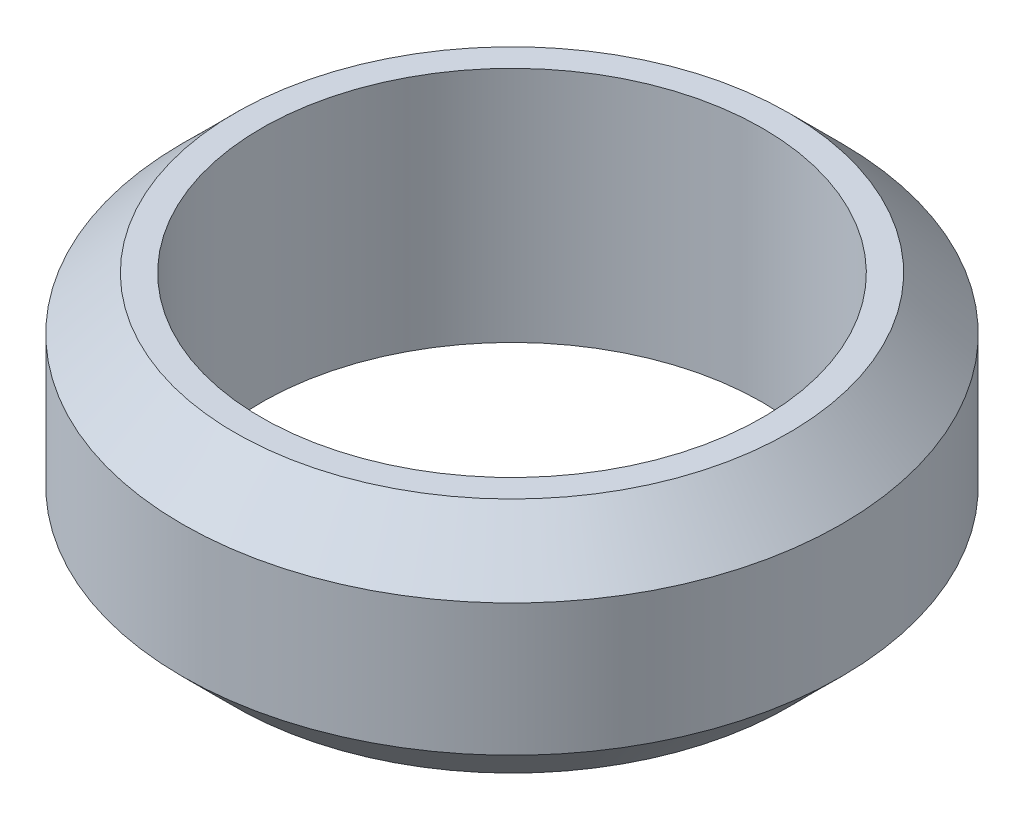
ISO-10303-21;
HEADER;
FILE_DESCRIPTION(('STEP AP214'),'2;1');
FILE_NAME('part.step','',(''),(''),'','','');
FILE_SCHEMA(('AUTOMOTIVE_DESIGN { 1 0 10303 214 1 1 1 1 }'));
ENDSEC;
DATA;
#1=APPLICATION_CONTEXT('core data for automotive mechanical design processes');
#2=APPLICATION_PROTOCOL_DEFINITION('international standard','automotive_design',2000,#1);
#3=PRODUCT_CONTEXT('',#1,'mechanical');
#4=PRODUCT('Part','Part','',(#3));
#5=PRODUCT_RELATED_PRODUCT_CATEGORY('part','',(#4));
#6=PRODUCT_DEFINITION_FORMATION('','',#4);
#7=PRODUCT_DEFINITION_CONTEXT('part definition',#1,'design');
#8=PRODUCT_DEFINITION('design','',#6,#7);
#9=PRODUCT_DEFINITION_SHAPE('','',#8);
#10=(LENGTH_UNIT() NAMED_UNIT(*) SI_UNIT(.MILLI.,.METRE.));
#11=(NAMED_UNIT(*) PLANE_ANGLE_UNIT() SI_UNIT($,.RADIAN.));
#12=(NAMED_UNIT(*) SI_UNIT($,.STERADIAN.) SOLID_ANGLE_UNIT());
#13=UNCERTAINTY_MEASURE_WITH_UNIT(LENGTH_MEASURE(1.E-05),#10,'distance_accuracy_value','');
#14=(GEOMETRIC_REPRESENTATION_CONTEXT(3) GLOBAL_UNCERTAINTY_ASSIGNED_CONTEXT((#13)) GLOBAL_UNIT_ASSIGNED_CONTEXT((#10,
#11,#12)) REPRESENTATION_CONTEXT('',''));
#15=CARTESIAN_POINT('',(0.,0.,0.));
#16=DIRECTION('',(0.,0.,1.));
#17=DIRECTION('',(1.,0.,0.));
#18=AXIS2_PLACEMENT_3D('',#15,#16,#17);
#19=CARTESIAN_POINT('',(0.,0.,0.));
#20=DIRECTION('',(0.,-1.,0.));
#21=DIRECTION('',(0.,0.,-1.));
#22=AXIS2_PLACEMENT_3D('',#19,#20,#21);
#23=CYLINDRICAL_SURFACE('',#22,19.);
#24=CARTESIAN_POINT('',(0.,13.6071271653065,0.));
#25=DIRECTION('',(0.,-1.,0.));
#26=DIRECTION('',(0.,0.,-1.));
#27=AXIS2_PLACEMENT_3D('',#24,#25,#26);
#28=CIRCLE('',#27,19.);
#29=CARTESIAN_POINT('',(0.,13.6071271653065,-19.));
#30=VERTEX_POINT('',#29);
#31=EDGE_CURVE('E61',#30,#30,#28,.T.);
#32=ORIENTED_EDGE('',*,*,#31,.F.);
#33=EDGE_LOOP('',(#32));
#34=FACE_BOUND('',#33,.T.);
#35=CARTESIAN_POINT('',(0.,-4.39287283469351,0.));
#36=DIRECTION('',(0.,-1.,0.));
#37=DIRECTION('',(0.,0.,-1.));
#38=AXIS2_PLACEMENT_3D('',#35,#36,#37);
#39=CIRCLE('',#38,19.);
#40=CARTESIAN_POINT('',(0.,-4.39287283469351,-19.));
#41=VERTEX_POINT('',#40);
#42=EDGE_CURVE('E12',#41,#41,#39,.T.);
#43=ORIENTED_EDGE('',*,*,#42,.T.);
#44=EDGE_LOOP('',(#43));
#45=FACE_BOUND('',#44,.T.);
#46=ADVANCED_FACE('F39',(#34,#45),#23,.F.);
#47=CARTESIAN_POINT('',(-19.,-4.39287283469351,0.));
#48=DIRECTION('',(0.,1.,0.));
#49=DIRECTION('',(0.,0.,1.));
#50=AXIS2_PLACEMENT_3D('',#47,#48,#49);
#51=PLANE('',#50);
#52=ORIENTED_EDGE('',*,*,#42,.F.);
#53=EDGE_LOOP('',(#52));
#54=FACE_BOUND('',#53,.T.);
#55=CARTESIAN_POINT('',(0.,-4.39287283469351,0.));
#56=DIRECTION('',(0.,-1.,0.));
#57=DIRECTION('',(0.,0.,-1.));
#58=AXIS2_PLACEMENT_3D('',#55,#56,#57);
#59=CIRCLE('',#58,21.);
#60=CARTESIAN_POINT('',(0.,-4.39287283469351,-21.));
#61=VERTEX_POINT('',#60);
#62=EDGE_CURVE('E45',#61,#61,#59,.T.);
#63=ORIENTED_EDGE('',*,*,#62,.T.);
#64=EDGE_LOOP('',(#63));
#65=FACE_BOUND('',#64,.T.);
#66=ADVANCED_FACE('F68',(#54,#65),#51,.F.);
#67=CARTESIAN_POINT('',(0.,-0.392872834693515,0.));
#68=DIRECTION('',(0.,1.,0.));
#69=DIRECTION('',(0.,0.,1.));
#70=AXIS2_PLACEMENT_3D('',#67,#68,#69);
#71=CONICAL_SURFACE('',#70,25.,0.785398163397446);
#72=ORIENTED_EDGE('',*,*,#62,.F.);
#73=EDGE_LOOP('',(#72));
#74=FACE_BOUND('',#73,.T.);
#75=CARTESIAN_POINT('',(0.,-0.392872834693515,0.));
#76=DIRECTION('',(0.,-1.,0.));
#77=DIRECTION('',(0.,0.,-1.));
#78=AXIS2_PLACEMENT_3D('',#75,#76,#77);
#79=CIRCLE('',#78,25.);
#80=CARTESIAN_POINT('',(0.,-0.392872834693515,-25.));
#81=VERTEX_POINT('',#80);
#82=EDGE_CURVE('E49',#81,#81,#79,.T.);
#83=ORIENTED_EDGE('',*,*,#82,.T.);
#84=EDGE_LOOP('',(#83));
#85=FACE_BOUND('',#84,.T.);
#86=ADVANCED_FACE('F72',(#74,#85),#71,.T.);
#87=CARTESIAN_POINT('',(0.,0.,0.));
#88=DIRECTION('',(0.,-1.,0.));
#89=DIRECTION('',(0.,0.,-1.));
#90=AXIS2_PLACEMENT_3D('',#87,#88,#89);
#91=CYLINDRICAL_SURFACE('',#90,25.);
#92=ORIENTED_EDGE('',*,*,#82,.F.);
#93=EDGE_LOOP('',(#92));
#94=FACE_BOUND('',#93,.T.);
#95=CARTESIAN_POINT('',(0.,9.60712716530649,0.));
#96=DIRECTION('',(0.,-1.,0.));
#97=DIRECTION('',(0.,0.,-1.));
#98=AXIS2_PLACEMENT_3D('',#95,#96,#97);
#99=CIRCLE('',#98,25.);
#100=CARTESIAN_POINT('',(0.,9.60712716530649,-25.));
#101=VERTEX_POINT('',#100);
#102=EDGE_CURVE('E53',#101,#101,#99,.T.);
#103=ORIENTED_EDGE('',*,*,#102,.T.);
#104=EDGE_LOOP('',(#103));
#105=FACE_BOUND('',#104,.T.);
#106=ADVANCED_FACE('F77',(#94,#105),#91,.T.);
#107=CARTESIAN_POINT('',(0.,13.6071271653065,0.));
#108=DIRECTION('',(0.,-1.,0.));
#109=DIRECTION('',(0.,0.,-1.));
#110=AXIS2_PLACEMENT_3D('',#107,#108,#109);
#111=CONICAL_SURFACE('',#110,21.,0.785398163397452);
#112=ORIENTED_EDGE('',*,*,#102,.F.);
#113=EDGE_LOOP('',(#112));
#114=FACE_BOUND('',#113,.T.);
#115=CARTESIAN_POINT('',(0.,13.6071271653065,0.));
#116=DIRECTION('',(0.,-1.,0.));
#117=DIRECTION('',(0.,0.,-1.));
#118=AXIS2_PLACEMENT_3D('',#115,#116,#117);
#119=CIRCLE('',#118,21.);
#120=CARTESIAN_POINT('',(0.,13.6071271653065,-21.));
#121=VERTEX_POINT('',#120);
#122=EDGE_CURVE('E58',#121,#121,#119,.T.);
#123=ORIENTED_EDGE('',*,*,#122,.T.);
#124=EDGE_LOOP('',(#123));
#125=FACE_BOUND('',#124,.T.);
#126=ADVANCED_FACE('F83',(#114,#125),#111,.T.);
#127=CARTESIAN_POINT('',(-21.,13.6071271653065,0.));
#128=DIRECTION('',(0.,-1.,0.));
#129=DIRECTION('',(0.,0.,-1.));
#130=AXIS2_PLACEMENT_3D('',#127,#128,#129);
#131=PLANE('',#130);
#132=ORIENTED_EDGE('',*,*,#122,.F.);
#133=EDGE_LOOP('',(#132));
#134=FACE_BOUND('',#133,.T.);
#135=ORIENTED_EDGE('',*,*,#31,.T.);
#136=EDGE_LOOP('',(#135));
#137=FACE_BOUND('',#136,.T.);
#138=ADVANCED_FACE('F65',(#134,#137),#131,.F.);
#139=CLOSED_SHELL('',(#46,#66,#86,#106,#126,#138));
#140=MANIFOLD_SOLID_BREP('B2',#139);
#141=ADVANCED_BREP_SHAPE_REPRESENTATION('',(#18,#140),#14);
#142=SHAPE_DEFINITION_REPRESENTATION(#9,#141);
ENDSEC;
END-ISO-10303-21;
